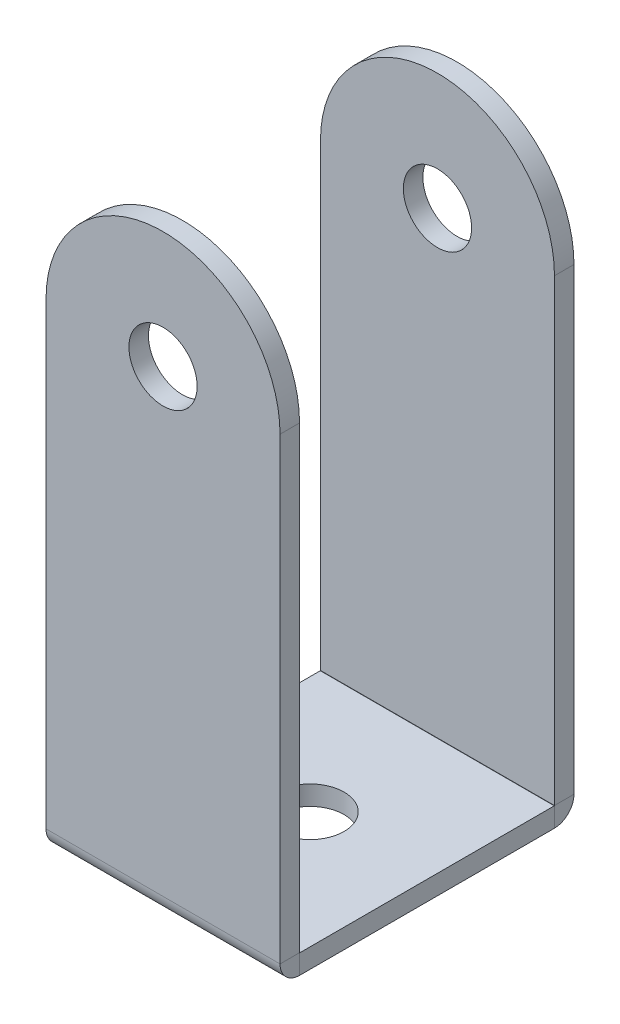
ISO-10303-21;
HEADER;
FILE_DESCRIPTION(('STEP AP214'),'2;1');
FILE_NAME('part.step','',(''),(''),'','','');
FILE_SCHEMA(('AUTOMOTIVE_DESIGN { 1 0 10303 214 1 1 1 1 }'));
ENDSEC;
DATA;
#1=APPLICATION_CONTEXT('core data for automotive mechanical design processes');
#2=APPLICATION_PROTOCOL_DEFINITION('international standard','automotive_design',2000,#1);
#3=PRODUCT_CONTEXT('',#1,'mechanical');
#4=PRODUCT('Part','Part','',(#3));
#5=PRODUCT_RELATED_PRODUCT_CATEGORY('part','',(#4));
#6=PRODUCT_DEFINITION_FORMATION('','',#4);
#7=PRODUCT_DEFINITION_CONTEXT('part definition',#1,'design');
#8=PRODUCT_DEFINITION('design','',#6,#7);
#9=PRODUCT_DEFINITION_SHAPE('','',#8);
#10=(LENGTH_UNIT() NAMED_UNIT(*) SI_UNIT(.MILLI.,.METRE.));
#11=(NAMED_UNIT(*) PLANE_ANGLE_UNIT() SI_UNIT($,.RADIAN.));
#12=(NAMED_UNIT(*) SI_UNIT($,.STERADIAN.) SOLID_ANGLE_UNIT());
#13=UNCERTAINTY_MEASURE_WITH_UNIT(LENGTH_MEASURE(1.E-05),#10,'distance_accuracy_value','');
#14=(GEOMETRIC_REPRESENTATION_CONTEXT(3) GLOBAL_UNCERTAINTY_ASSIGNED_CONTEXT((#13)) GLOBAL_UNIT_ASSIGNED_CONTEXT((#10,
#11,#12)) REPRESENTATION_CONTEXT('',''));
#15=CARTESIAN_POINT('',(0.,0.,0.));
#16=DIRECTION('',(0.,0.,1.));
#17=DIRECTION('',(1.,0.,0.));
#18=AXIS2_PLACEMENT_3D('',#15,#16,#17);
#19=CARTESIAN_POINT('',(0.,-3.72914867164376,-23.4635950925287));
#20=DIRECTION('',(0.,1.,0.));
#21=DIRECTION('',(1.,0.,0.));
#22=AXIS2_PLACEMENT_3D('',#19,#20,#21);
#23=PLANE('',#22);
#24=CARTESIAN_POINT('',(0.,-3.72914867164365,7.53640490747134));
#25=DIRECTION('',(0.,1.,0.));
#26=DIRECTION('',(1.,0.,0.));
#27=AXIS2_PLACEMENT_3D('',#24,#25,#26);
#28=CIRCLE('',#27,1.75);
#29=CARTESIAN_POINT('',(1.75,-3.72914867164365,7.53640490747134));
#30=VERTEX_POINT('',#29);
#31=EDGE_CURVE('E174',#30,#30,#28,.T.);
#32=ORIENTED_EDGE('',*,*,#31,.F.);
#33=EDGE_LOOP('',(#32));
#34=FACE_BOUND('',#33,.T.);
#35=DIRECTION('',(0.,0.,-1.));
#36=VECTOR('',#35,1.);
#37=CARTESIAN_POINT('',(6.,-3.72914867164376,-23.4635950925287));
#38=LINE('',#37,#36);
#39=CARTESIAN_POINT('',(6.,-3.72914867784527,14.0628098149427));
#40=VERTEX_POINT('',#39);
#41=CARTESIAN_POINT('',(6.,-3.72914867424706,1.01));
#42=VERTEX_POINT('',#41);
#43=EDGE_CURVE('E46',#40,#42,#38,.T.);
#44=ORIENTED_EDGE('',*,*,#43,.T.);
#45=DIRECTION('',(-1.,0.,0.));
#46=VECTOR('',#45,1.);
#47=CARTESIAN_POINT('',(0.,-3.72914867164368,1.01));
#48=LINE('',#47,#46);
#49=CARTESIAN_POINT('',(-6.,-3.72914867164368,1.01));
#50=VERTEX_POINT('',#49);
#51=EDGE_CURVE('E144',#42,#50,#48,.T.);
#52=ORIENTED_EDGE('',*,*,#51,.T.);
#53=DIRECTION('',(0.,0.,1.));
#54=VECTOR('',#53,1.);
#55=CARTESIAN_POINT('',(-6.,-3.72914867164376,-23.4635950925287));
#56=LINE('',#55,#54);
#57=CARTESIAN_POINT('',(-6.,-3.72914868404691,14.0628098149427));
#58=VERTEX_POINT('',#57);
#59=EDGE_CURVE('E163',#50,#58,#56,.T.);
#60=ORIENTED_EDGE('',*,*,#59,.T.);
#61=DIRECTION('',(-1.,0.,0.));
#62=VECTOR('',#61,1.);
#63=CARTESIAN_POINT('',(0.,-3.72914867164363,14.0628098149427));
#64=LINE('',#63,#62);
#65=EDGE_CURVE('E181',#40,#58,#64,.T.);
#66=ORIENTED_EDGE('',*,*,#65,.F.);
#67=EDGE_LOOP('',(#44,#52,#60,#66));
#68=FACE_BOUND('',#67,.T.);
#69=ADVANCED_FACE('F42',(#34,#68),#23,.T.);
#70=CARTESIAN_POINT('',(6.,-3.72914867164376,-23.4635950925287));
#71=DIRECTION('',(-1.,0.,0.));
#72=DIRECTION('',(0.,0.,1.));
#73=AXIS2_PLACEMENT_3D('',#70,#71,#72);
#74=PLANE('',#73);
#75=DIRECTION('',(0.,-1.,0.));
#76=VECTOR('',#75,1.);
#77=CARTESIAN_POINT('',(6.,-3.72914867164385,1.01));
#78=LINE('',#77,#76);
#79=CARTESIAN_POINT('',(6.,-4.72914867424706,1.01));
#80=VERTEX_POINT('',#79);
#81=EDGE_CURVE('E133',#42,#80,#78,.T.);
#82=ORIENTED_EDGE('',*,*,#81,.F.);
#83=ORIENTED_EDGE('',*,*,#43,.F.);
#84=DIRECTION('',(0.,-1.,0.));
#85=VECTOR('',#84,1.);
#86=CARTESIAN_POINT('',(6.,-3.72914867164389,14.0628098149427));
#87=LINE('',#86,#85);
#88=CARTESIAN_POINT('',(6.,-4.72914867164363,14.0628098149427));
#89=VERTEX_POINT('',#88);
#90=EDGE_CURVE('E160',#40,#89,#87,.T.);
#91=ORIENTED_EDGE('',*,*,#90,.T.);
#92=DIRECTION('',(0.,0.,-1.));
#93=VECTOR('',#92,1.);
#94=CARTESIAN_POINT('',(6.,-4.72914867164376,-23.4635950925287));
#95=LINE('',#94,#93);
#96=EDGE_CURVE('E158',#89,#80,#95,.T.);
#97=ORIENTED_EDGE('',*,*,#96,.T.);
#98=EDGE_LOOP('',(#82,#83,#91,#97));
#99=FACE_BOUND('',#98,.T.);
#100=ADVANCED_FACE('F159',(#99),#74,.F.);
#101=CARTESIAN_POINT('',(-6.,-3.72914867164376,-23.4635950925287));
#102=DIRECTION('',(1.,0.,0.));
#103=DIRECTION('',(0.,0.,-1.));
#104=AXIS2_PLACEMENT_3D('',#101,#102,#103);
#105=PLANE('',#104);
#106=DIRECTION('',(0.,1.,0.));
#107=VECTOR('',#106,1.);
#108=CARTESIAN_POINT('',(-6.,-3.72914867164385,1.01));
#109=LINE('',#108,#107);
#110=CARTESIAN_POINT('',(-6.,-4.72914867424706,1.01));
#111=VERTEX_POINT('',#110);
#112=EDGE_CURVE('E12',#111,#50,#109,.T.);
#113=ORIENTED_EDGE('',*,*,#112,.F.);
#114=DIRECTION('',(0.,0.,1.));
#115=VECTOR('',#114,1.);
#116=CARTESIAN_POINT('',(-6.,-4.72914867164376,-23.4635950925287));
#117=LINE('',#116,#115);
#118=CARTESIAN_POINT('',(-6.,-4.72914868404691,14.0628098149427));
#119=VERTEX_POINT('',#118);
#120=EDGE_CURVE('E164',#111,#119,#117,.T.);
#121=ORIENTED_EDGE('',*,*,#120,.T.);
#122=DIRECTION('',(0.,1.,0.));
#123=VECTOR('',#122,1.);
#124=CARTESIAN_POINT('',(-6.,-3.72914867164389,14.0628098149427));
#125=LINE('',#124,#123);
#126=EDGE_CURVE('E182',#119,#58,#125,.T.);
#127=ORIENTED_EDGE('',*,*,#126,.T.);
#128=ORIENTED_EDGE('',*,*,#59,.F.);
#129=EDGE_LOOP('',(#113,#121,#127,#128));
#130=FACE_BOUND('',#129,.T.);
#131=ADVANCED_FACE('F44',(#130),#105,.F.);
#132=CARTESIAN_POINT('',(0.,-4.72914867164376,-23.4635950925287));
#133=DIRECTION('',(0.,1.,0.));
#134=DIRECTION('',(1.,0.,0.));
#135=AXIS2_PLACEMENT_3D('',#132,#133,#134);
#136=PLANE('',#135);
#137=DIRECTION('',(-1.,0.,0.));
#138=VECTOR('',#137,1.);
#139=CARTESIAN_POINT('',(0.,-4.72914867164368,1.01));
#140=LINE('',#139,#138);
#141=EDGE_CURVE('E51',#80,#111,#140,.T.);
#142=ORIENTED_EDGE('',*,*,#141,.F.);
#143=ORIENTED_EDGE('',*,*,#96,.F.);
#144=DIRECTION('',(-1.,0.,0.));
#145=VECTOR('',#144,1.);
#146=CARTESIAN_POINT('',(0.,-4.72914867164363,14.0628098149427));
#147=LINE('',#146,#145);
#148=EDGE_CURVE('E188',#89,#119,#147,.T.);
#149=ORIENTED_EDGE('',*,*,#148,.T.);
#150=ORIENTED_EDGE('',*,*,#120,.F.);
#151=EDGE_LOOP('',(#142,#143,#149,#150));
#152=FACE_BOUND('',#151,.T.);
#153=CARTESIAN_POINT('',(0.,-4.72914867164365,7.53640490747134));
#154=DIRECTION('',(0.,1.,0.));
#155=DIRECTION('',(1.,0.,0.));
#156=AXIS2_PLACEMENT_3D('',#153,#154,#155);
#157=CIRCLE('',#156,1.75);
#158=CARTESIAN_POINT('',(1.75,-4.72914867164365,7.53640490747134));
#159=VERTEX_POINT('',#158);
#160=EDGE_CURVE('E214',#159,#159,#157,.T.);
#161=ORIENTED_EDGE('',*,*,#160,.T.);
#162=EDGE_LOOP('',(#161));
#163=FACE_BOUND('',#162,.T.);
#164=ADVANCED_FACE('F167',(#152,#163),#136,.F.);
#165=CARTESIAN_POINT('',(0.,-3.72914867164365,7.53640490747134));
#166=DIRECTION('',(0.,-1.,0.));
#167=DIRECTION('',(-1.,0.,0.));
#168=AXIS2_PLACEMENT_3D('',#165,#166,#167);
#169=CYLINDRICAL_SURFACE('',#168,1.75);
#170=ORIENTED_EDGE('',*,*,#31,.T.);
#171=EDGE_LOOP('',(#170));
#172=FACE_BOUND('',#171,.T.);
#173=ORIENTED_EDGE('',*,*,#160,.F.);
#174=EDGE_LOOP('',(#173));
#175=FACE_BOUND('',#174,.T.);
#176=ADVANCED_FACE('F220',(#172,#175),#169,.F.);
#177=CARTESIAN_POINT('',(6.,-3.71914865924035,14.0628098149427));
#178=DIRECTION('',(-1.,0.,0.));
#179=DIRECTION('',(0.,1.,0.));
#180=AXIS2_PLACEMENT_3D('',#177,#178,#179);
#181=PLANE('',#180);
#182=DIRECTION('',(0.,0.,1.));
#183=VECTOR('',#182,1.);
#184=CARTESIAN_POINT('',(6.,-3.71914867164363,14.072809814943));
#185=LINE('',#184,#183);
#186=CARTESIAN_POINT('',(6.,-3.71914867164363,14.072809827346));
#187=VERTEX_POINT('',#186);
#188=CARTESIAN_POINT('',(6.,-3.71914867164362,15.0728098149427));
#189=VERTEX_POINT('',#188);
#190=EDGE_CURVE('E538',#187,#189,#185,.T.);
#191=ORIENTED_EDGE('',*,*,#190,.T.);
#192=CARTESIAN_POINT('',(6.,-3.71914867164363,14.0628098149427));
#193=DIRECTION('',(1.,0.,0.));
#194=DIRECTION('',(0.,-1.,0.));
#195=AXIS2_PLACEMENT_3D('',#192,#193,#194);
#196=CIRCLE('',#195,1.01000001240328);
#197=EDGE_CURVE('E59',#189,#89,#196,.T.);
#198=ORIENTED_EDGE('',*,*,#197,.T.);
#199=ORIENTED_EDGE('',*,*,#90,.F.);
#200=CARTESIAN_POINT('',(6.,-3.71914865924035,14.0628098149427));
#201=DIRECTION('',(1.,0.,0.));
#202=DIRECTION('',(0.,-1.,0.));
#203=AXIS2_PLACEMENT_3D('',#200,#201,#202);
#204=CIRCLE('',#203,0.0100000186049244);
#205=EDGE_CURVE('E207',#187,#40,#204,.T.);
#206=ORIENTED_EDGE('',*,*,#205,.F.);
#207=EDGE_LOOP('',(#191,#198,#199,#206));
#208=FACE_BOUND('',#207,.T.);
#209=ADVANCED_FACE('F236',(#208),#181,.F.);
#210=CARTESIAN_POINT('',(-6.,-3.71914865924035,14.0628098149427));
#211=DIRECTION('',(1.,0.,0.));
#212=DIRECTION('',(0.,-1.,0.));
#213=AXIS2_PLACEMENT_3D('',#210,#211,#212);
#214=PLANE('',#213);
#215=CARTESIAN_POINT('',(-6.,-3.71914867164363,14.0628098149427));
#216=DIRECTION('',(1.,0.,0.));
#217=DIRECTION('',(0.,-1.,0.));
#218=AXIS2_PLACEMENT_3D('',#215,#216,#217);
#219=CIRCLE('',#218,1.01000001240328);
#220=CARTESIAN_POINT('',(-6.,-3.71914867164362,15.0728098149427));
#221=VERTEX_POINT('',#220);
#222=EDGE_CURVE('E200',#119,#221,#219,.F.);
#223=ORIENTED_EDGE('',*,*,#222,.T.);
#224=DIRECTION('',(0.,0.,-1.));
#225=VECTOR('',#224,1.);
#226=CARTESIAN_POINT('',(-6.,-3.71914867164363,14.072809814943));
#227=LINE('',#226,#225);
#228=CARTESIAN_POINT('',(-6.,-3.71914867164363,14.0728098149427));
#229=VERTEX_POINT('',#228);
#230=EDGE_CURVE('E510',#221,#229,#227,.T.);
#231=ORIENTED_EDGE('',*,*,#230,.T.);
#232=CARTESIAN_POINT('',(-6.,-3.71914865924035,14.0628098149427));
#233=DIRECTION('',(-1.,0.,0.));
#234=DIRECTION('',(0.,1.,0.));
#235=AXIS2_PLACEMENT_3D('',#232,#233,#234);
#236=CIRCLE('',#235,0.0100000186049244);
#237=EDGE_CURVE('E201',#58,#229,#236,.T.);
#238=ORIENTED_EDGE('',*,*,#237,.F.);
#239=ORIENTED_EDGE('',*,*,#126,.F.);
#240=EDGE_LOOP('',(#223,#231,#238,#239));
#241=FACE_BOUND('',#240,.T.);
#242=ADVANCED_FACE('F198',(#241),#214,.F.);
#243=CARTESIAN_POINT('',(-12.0787900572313,-3.71914867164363,14.0628098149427));
#244=DIRECTION('',(1.,0.,0.));
#245=DIRECTION('',(0.,-1.,0.));
#246=AXIS2_PLACEMENT_3D('',#243,#244,#245);
#247=CYLINDRICAL_SURFACE('',#246,0.0100000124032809);
#248=ORIENTED_EDGE('',*,*,#65,.T.);
#249=ORIENTED_EDGE('',*,*,#237,.T.);
#250=DIRECTION('',(-1.,0.,0.));
#251=VECTOR('',#250,1.);
#252=CARTESIAN_POINT('',(0.,-3.71914867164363,14.0728098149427));
#253=LINE('',#252,#251);
#254=EDGE_CURVE('E530',#187,#229,#253,.T.);
#255=ORIENTED_EDGE('',*,*,#254,.F.);
#256=ORIENTED_EDGE('',*,*,#205,.T.);
#257=EDGE_LOOP('',(#248,#249,#255,#256));
#258=FACE_BOUND('',#257,.T.);
#259=ADVANCED_FACE('F276',(#258),#247,.F.);
#260=CARTESIAN_POINT('',(-12.0787900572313,-3.71914867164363,14.0628098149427));
#261=DIRECTION('',(1.,0.,0.));
#262=DIRECTION('',(0.,-1.,0.));
#263=AXIS2_PLACEMENT_3D('',#260,#261,#262);
#264=CYLINDRICAL_SURFACE('',#263,1.01000001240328);
#265=ORIENTED_EDGE('',*,*,#148,.F.);
#266=ORIENTED_EDGE('',*,*,#197,.F.);
#267=DIRECTION('',(-1.,0.,0.));
#268=VECTOR('',#267,1.);
#269=CARTESIAN_POINT('',(0.,-3.71914867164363,15.0728098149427));
#270=LINE('',#269,#268);
#271=EDGE_CURVE('E206',#189,#221,#270,.T.);
#272=ORIENTED_EDGE('',*,*,#271,.T.);
#273=ORIENTED_EDGE('',*,*,#222,.F.);
#274=EDGE_LOOP('',(#265,#266,#272,#273));
#275=FACE_BOUND('',#274,.T.);
#276=ADVANCED_FACE('F204',(#275),#264,.T.);
#277=CARTESIAN_POINT('',(0.,19.8072562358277,14.0728098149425));
#278=DIRECTION('',(0.,0.,1.));
#279=DIRECTION('',(-1.,0.,0.));
#280=AXIS2_PLACEMENT_3D('',#277,#278,#279);
#281=CYLINDRICAL_SURFACE('',#280,6.);
#282=CARTESIAN_POINT('',(0.,19.8072562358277,15.0728098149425));
#283=DIRECTION('',(0.,0.,-1.));
#284=DIRECTION('',(1.,0.,0.));
#285=AXIS2_PLACEMENT_3D('',#282,#283,#284);
#286=CIRCLE('',#285,6.);
#287=CARTESIAN_POINT('',(-6.,19.8072562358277,15.0728098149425));
#288=VERTEX_POINT('',#287);
#289=CARTESIAN_POINT('',(6.,19.8072562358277,15.0728098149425));
#290=VERTEX_POINT('',#289);
#291=EDGE_CURVE('E502',#288,#290,#286,.T.);
#292=ORIENTED_EDGE('',*,*,#291,.T.);
#293=DIRECTION('',(0.,0.,1.));
#294=VECTOR('',#293,1.);
#295=CARTESIAN_POINT('',(6.,19.8072562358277,14.0728098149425));
#296=LINE('',#295,#294);
#297=CARTESIAN_POINT('',(6.,19.8072562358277,14.0728098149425));
#298=VERTEX_POINT('',#297);
#299=EDGE_CURVE('E505',#298,#290,#296,.T.);
#300=ORIENTED_EDGE('',*,*,#299,.F.);
#301=CARTESIAN_POINT('',(0.,19.8072562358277,14.0728098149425));
#302=DIRECTION('',(0.,0.,-1.));
#303=DIRECTION('',(1.,0.,0.));
#304=AXIS2_PLACEMENT_3D('',#301,#302,#303);
#305=CIRCLE('',#304,6.);
#306=CARTESIAN_POINT('',(-6.,19.8072562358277,14.0728098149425));
#307=VERTEX_POINT('',#306);
#308=EDGE_CURVE('E526',#307,#298,#305,.T.);
#309=ORIENTED_EDGE('',*,*,#308,.F.);
#310=DIRECTION('',(0.,0.,1.));
#311=VECTOR('',#310,1.);
#312=CARTESIAN_POINT('',(-6.,19.8072562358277,14.0728098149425));
#313=LINE('',#312,#311);
#314=EDGE_CURVE('E508',#307,#288,#313,.T.);
#315=ORIENTED_EDGE('',*,*,#314,.T.);
#316=EDGE_LOOP('',(#292,#300,#309,#315));
#317=FACE_BOUND('',#316,.T.);
#318=ADVANCED_FACE('F302',(#317),#281,.T.);
#319=CARTESIAN_POINT('',(0.,19.8072562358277,14.0728098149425));
#320=DIRECTION('',(0.,0.,1.));
#321=DIRECTION('',(-1.,0.,0.));
#322=AXIS2_PLACEMENT_3D('',#319,#320,#321);
#323=CYLINDRICAL_SURFACE('',#322,1.75);
#324=CARTESIAN_POINT('',(0.,19.8072562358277,14.0728098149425));
#325=DIRECTION('',(0.,0.,-1.));
#326=DIRECTION('',(1.,0.,0.));
#327=AXIS2_PLACEMENT_3D('',#324,#325,#326);
#328=CIRCLE('',#327,1.75);
#329=CARTESIAN_POINT('',(1.75,19.8072562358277,14.0728098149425));
#330=VERTEX_POINT('',#329);
#331=EDGE_CURVE('E533',#330,#330,#328,.T.);
#332=ORIENTED_EDGE('',*,*,#331,.T.);
#333=EDGE_LOOP('',(#332));
#334=FACE_BOUND('',#333,.T.);
#335=CARTESIAN_POINT('',(0.,19.8072562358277,15.0728098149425));
#336=DIRECTION('',(0.,0.,-1.));
#337=DIRECTION('',(1.,0.,0.));
#338=AXIS2_PLACEMENT_3D('',#335,#336,#337);
#339=CIRCLE('',#338,1.75);
#340=CARTESIAN_POINT('',(1.75,19.8072562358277,15.0728098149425));
#341=VERTEX_POINT('',#340);
#342=EDGE_CURVE('E514',#341,#341,#339,.T.);
#343=ORIENTED_EDGE('',*,*,#342,.F.);
#344=EDGE_LOOP('',(#343));
#345=FACE_BOUND('',#344,.T.);
#346=ADVANCED_FACE('F316',(#334,#345),#323,.F.);
#347=CARTESIAN_POINT('',(0.,-42.1927437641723,14.072809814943));
#348=DIRECTION('',(0.,0.,-1.));
#349=DIRECTION('',(1.,0.,0.));
#350=AXIS2_PLACEMENT_3D('',#347,#348,#349);
#351=PLANE('',#350);
#352=ORIENTED_EDGE('',*,*,#331,.F.);
#353=EDGE_LOOP('',(#352));
#354=FACE_BOUND('',#353,.T.);
#355=DIRECTION('',(0.,-1.,0.));
#356=VECTOR('',#355,1.);
#357=CARTESIAN_POINT('',(6.,-42.1927437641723,14.072809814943));
#358=LINE('',#357,#356);
#359=EDGE_CURVE('E513',#298,#187,#358,.T.);
#360=ORIENTED_EDGE('',*,*,#359,.T.);
#361=ORIENTED_EDGE('',*,*,#254,.T.);
#362=DIRECTION('',(0.,1.,0.));
#363=VECTOR('',#362,1.);
#364=CARTESIAN_POINT('',(-6.,-42.1927437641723,14.072809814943));
#365=LINE('',#364,#363);
#366=EDGE_CURVE('E528',#229,#307,#365,.T.);
#367=ORIENTED_EDGE('',*,*,#366,.T.);
#368=ORIENTED_EDGE('',*,*,#308,.T.);
#369=EDGE_LOOP('',(#360,#361,#367,#368));
#370=FACE_BOUND('',#369,.T.);
#371=ADVANCED_FACE('F308',(#354,#370),#351,.T.);
#372=CARTESIAN_POINT('',(-6.,-42.1927437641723,14.072809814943));
#373=DIRECTION('',(1.,0.,0.));
#374=DIRECTION('',(0.,-1.,0.));
#375=AXIS2_PLACEMENT_3D('',#372,#373,#374);
#376=PLANE('',#375);
#377=ORIENTED_EDGE('',*,*,#230,.F.);
#378=DIRECTION('',(0.,1.,0.));
#379=VECTOR('',#378,1.);
#380=CARTESIAN_POINT('',(-6.,-42.1927437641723,15.072809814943));
#381=LINE('',#380,#379);
#382=EDGE_CURVE('E524',#221,#288,#381,.T.);
#383=ORIENTED_EDGE('',*,*,#382,.T.);
#384=ORIENTED_EDGE('',*,*,#314,.F.);
#385=ORIENTED_EDGE('',*,*,#366,.F.);
#386=EDGE_LOOP('',(#377,#383,#384,#385));
#387=FACE_BOUND('',#386,.T.);
#388=ADVANCED_FACE('F315',(#387),#376,.F.);
#389=CARTESIAN_POINT('',(0.,-42.1927437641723,15.072809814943));
#390=DIRECTION('',(0.,0.,-1.));
#391=DIRECTION('',(1.,0.,0.));
#392=AXIS2_PLACEMENT_3D('',#389,#390,#391);
#393=PLANE('',#392);
#394=ORIENTED_EDGE('',*,*,#271,.F.);
#395=DIRECTION('',(0.,-1.,0.));
#396=VECTOR('',#395,1.);
#397=CARTESIAN_POINT('',(6.,-42.1927437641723,15.072809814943));
#398=LINE('',#397,#396);
#399=EDGE_CURVE('E210',#290,#189,#398,.T.);
#400=ORIENTED_EDGE('',*,*,#399,.F.);
#401=ORIENTED_EDGE('',*,*,#291,.F.);
#402=ORIENTED_EDGE('',*,*,#382,.F.);
#403=EDGE_LOOP('',(#394,#400,#401,#402));
#404=FACE_BOUND('',#403,.T.);
#405=ORIENTED_EDGE('',*,*,#342,.T.);
#406=EDGE_LOOP('',(#405));
#407=FACE_BOUND('',#406,.T.);
#408=ADVANCED_FACE('F325',(#404,#407),#393,.F.);
#409=CARTESIAN_POINT('',(6.,-42.1927437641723,14.072809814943));
#410=DIRECTION('',(-1.,0.,0.));
#411=DIRECTION('',(0.,1.,0.));
#412=AXIS2_PLACEMENT_3D('',#409,#410,#411);
#413=PLANE('',#412);
#414=ORIENTED_EDGE('',*,*,#190,.F.);
#415=ORIENTED_EDGE('',*,*,#359,.F.);
#416=ORIENTED_EDGE('',*,*,#299,.T.);
#417=ORIENTED_EDGE('',*,*,#399,.T.);
#418=EDGE_LOOP('',(#414,#415,#416,#417));
#419=FACE_BOUND('',#418,.T.);
#420=ADVANCED_FACE('F332',(#419),#413,.F.);
#421=CARTESIAN_POINT('',(0.,19.8072562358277,1.));
#422=DIRECTION('',(0.,0.,-1.));
#423=DIRECTION('',(-1.,0.,0.));
#424=AXIS2_PLACEMENT_3D('',#421,#422,#423);
#425=CYLINDRICAL_SURFACE('',#424,1.75);
#426=CARTESIAN_POINT('',(0.,19.8072562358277,1.));
#427=DIRECTION('',(0.,0.,1.));
#428=DIRECTION('',(1.,0.,0.));
#429=AXIS2_PLACEMENT_3D('',#426,#427,#428);
#430=CIRCLE('',#429,1.75);
#431=CARTESIAN_POINT('',(1.75,19.8072562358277,1.));
#432=VERTEX_POINT('',#431);
#433=EDGE_CURVE('E575',#432,#432,#430,.T.);
#434=ORIENTED_EDGE('',*,*,#433,.T.);
#435=EDGE_LOOP('',(#434));
#436=FACE_BOUND('',#435,.T.);
#437=CARTESIAN_POINT('',(0.,19.8072562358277,0.));
#438=DIRECTION('',(0.,0.,1.));
#439=DIRECTION('',(1.,0.,0.));
#440=AXIS2_PLACEMENT_3D('',#437,#438,#439);
#441=CIRCLE('',#440,1.75);
#442=CARTESIAN_POINT('',(1.75,19.8072562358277,0.));
#443=VERTEX_POINT('',#442);
#444=EDGE_CURVE('E555',#443,#443,#441,.T.);
#445=ORIENTED_EDGE('',*,*,#444,.F.);
#446=EDGE_LOOP('',(#445));
#447=FACE_BOUND('',#446,.T.);
#448=ADVANCED_FACE('F419',(#436,#447),#425,.F.);
#449=CARTESIAN_POINT('',(0.,19.8072562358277,1.));
#450=DIRECTION('',(0.,0.,-1.));
#451=DIRECTION('',(-1.,0.,0.));
#452=AXIS2_PLACEMENT_3D('',#449,#450,#451);
#453=CYLINDRICAL_SURFACE('',#452,6.);
#454=CARTESIAN_POINT('',(0.,19.8072562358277,0.));
#455=DIRECTION('',(0.,0.,1.));
#456=DIRECTION('',(1.,0.,0.));
#457=AXIS2_PLACEMENT_3D('',#454,#455,#456);
#458=CIRCLE('',#457,6.);
#459=CARTESIAN_POINT('',(6.,19.8072562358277,0.));
#460=VERTEX_POINT('',#459);
#461=CARTESIAN_POINT('',(-6.,19.8072562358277,0.));
#462=VERTEX_POINT('',#461);
#463=EDGE_CURVE('E574',#460,#462,#458,.T.);
#464=ORIENTED_EDGE('',*,*,#463,.T.);
#465=DIRECTION('',(0.,0.,-1.));
#466=VECTOR('',#465,1.);
#467=CARTESIAN_POINT('',(-6.,19.8072562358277,1.));
#468=LINE('',#467,#466);
#469=CARTESIAN_POINT('',(-6.,19.8072562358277,1.));
#470=VERTEX_POINT('',#469);
#471=EDGE_CURVE('E539',#470,#462,#468,.T.);
#472=ORIENTED_EDGE('',*,*,#471,.F.);
#473=CARTESIAN_POINT('',(0.,19.8072562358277,1.));
#474=DIRECTION('',(0.,0.,1.));
#475=DIRECTION('',(1.,0.,0.));
#476=AXIS2_PLACEMENT_3D('',#473,#474,#475);
#477=CIRCLE('',#476,6.);
#478=CARTESIAN_POINT('',(6.,19.8072562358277,1.));
#479=VERTEX_POINT('',#478);
#480=EDGE_CURVE('E566',#479,#470,#477,.T.);
#481=ORIENTED_EDGE('',*,*,#480,.F.);
#482=DIRECTION('',(0.,0.,-1.));
#483=VECTOR('',#482,1.);
#484=CARTESIAN_POINT('',(6.,19.8072562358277,1.));
#485=LINE('',#484,#483);
#486=EDGE_CURVE('E571',#479,#460,#485,.T.);
#487=ORIENTED_EDGE('',*,*,#486,.T.);
#488=EDGE_LOOP('',(#464,#472,#481,#487));
#489=FACE_BOUND('',#488,.T.);
#490=ADVANCED_FACE('F411',(#489),#453,.T.);
#491=CARTESIAN_POINT('',(0.,19.8072562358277,1.));
#492=DIRECTION('',(0.,0.,1.));
#493=DIRECTION('',(1.,0.,0.));
#494=AXIS2_PLACEMENT_3D('',#491,#492,#493);
#495=PLANE('',#494);
#496=DIRECTION('',(-1.,0.,0.));
#497=VECTOR('',#496,1.);
#498=CARTESIAN_POINT('',(0.,-3.71914867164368,1.));
#499=LINE('',#498,#497);
#500=CARTESIAN_POINT('',(6.,-3.71914867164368,0.999999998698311));
#501=VERTEX_POINT('',#500);
#502=CARTESIAN_POINT('',(-6.,-3.71914867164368,0.999999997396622));
#503=VERTEX_POINT('',#502);
#504=EDGE_CURVE('E519',#501,#503,#499,.T.);
#505=ORIENTED_EDGE('',*,*,#504,.F.);
#506=DIRECTION('',(0.,1.,0.));
#507=VECTOR('',#506,1.);
#508=CARTESIAN_POINT('',(6.,19.8072562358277,1.));
#509=LINE('',#508,#507);
#510=EDGE_CURVE('E569',#501,#479,#509,.T.);
#511=ORIENTED_EDGE('',*,*,#510,.T.);
#512=ORIENTED_EDGE('',*,*,#480,.T.);
#513=DIRECTION('',(0.,-1.,0.));
#514=VECTOR('',#513,1.);
#515=CARTESIAN_POINT('',(-6.,19.8072562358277,1.));
#516=LINE('',#515,#514);
#517=EDGE_CURVE('E563',#470,#503,#516,.T.);
#518=ORIENTED_EDGE('',*,*,#517,.T.);
#519=EDGE_LOOP('',(#505,#511,#512,#518));
#520=FACE_BOUND('',#519,.T.);
#521=ORIENTED_EDGE('',*,*,#433,.F.);
#522=EDGE_LOOP('',(#521));
#523=FACE_BOUND('',#522,.T.);
#524=ADVANCED_FACE('F404',(#520,#523),#495,.T.);
#525=CARTESIAN_POINT('',(6.,19.8072562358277,1.));
#526=DIRECTION('',(-1.,0.,0.));
#527=DIRECTION('',(0.,-1.,0.));
#528=AXIS2_PLACEMENT_3D('',#525,#526,#527);
#529=PLANE('',#528);
#530=ORIENTED_EDGE('',*,*,#510,.F.);
#531=DIRECTION('',(0.,0.,-1.));
#532=VECTOR('',#531,1.);
#533=CARTESIAN_POINT('',(6.,-3.71914867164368,0.999999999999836));
#534=LINE('',#533,#532);
#535=CARTESIAN_POINT('',(6.,-3.71914867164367,0.));
#536=VERTEX_POINT('',#535);
#537=EDGE_CURVE('E560',#501,#536,#534,.T.);
#538=ORIENTED_EDGE('',*,*,#537,.T.);
#539=DIRECTION('',(0.,1.,0.));
#540=VECTOR('',#539,1.);
#541=CARTESIAN_POINT('',(6.,19.8072562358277,0.));
#542=LINE('',#541,#540);
#543=EDGE_CURVE('E558',#536,#460,#542,.T.);
#544=ORIENTED_EDGE('',*,*,#543,.T.);
#545=ORIENTED_EDGE('',*,*,#486,.F.);
#546=EDGE_LOOP('',(#530,#538,#544,#545));
#547=FACE_BOUND('',#546,.T.);
#548=ADVANCED_FACE('F346',(#547),#529,.F.);
#549=CARTESIAN_POINT('',(0.,19.8072562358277,0.));
#550=DIRECTION('',(0.,0.,1.));
#551=DIRECTION('',(1.,0.,0.));
#552=AXIS2_PLACEMENT_3D('',#549,#550,#551);
#553=PLANE('',#552);
#554=ORIENTED_EDGE('',*,*,#444,.T.);
#555=EDGE_LOOP('',(#554));
#556=FACE_BOUND('',#555,.T.);
#557=ORIENTED_EDGE('',*,*,#543,.F.);
#558=DIRECTION('',(-1.,0.,0.));
#559=VECTOR('',#558,1.);
#560=CARTESIAN_POINT('',(0.,-3.71914867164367,0.));
#561=LINE('',#560,#559);
#562=CARTESIAN_POINT('',(-6.,-3.71914867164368,-2.60337823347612E-09));
#563=VERTEX_POINT('',#562);
#564=EDGE_CURVE('E152',#536,#563,#561,.T.);
#565=ORIENTED_EDGE('',*,*,#564,.T.);
#566=DIRECTION('',(0.,-1.,0.));
#567=VECTOR('',#566,1.);
#568=CARTESIAN_POINT('',(-6.,19.8072562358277,0.));
#569=LINE('',#568,#567);
#570=EDGE_CURVE('E548',#462,#563,#569,.T.);
#571=ORIENTED_EDGE('',*,*,#570,.F.);
#572=ORIENTED_EDGE('',*,*,#463,.F.);
#573=EDGE_LOOP('',(#557,#565,#571,#572));
#574=FACE_BOUND('',#573,.T.);
#575=ADVANCED_FACE('F339',(#556,#574),#553,.F.);
#576=CARTESIAN_POINT('',(-6.,19.8072562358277,1.));
#577=DIRECTION('',(1.,0.,0.));
#578=DIRECTION('',(0.,1.,0.));
#579=AXIS2_PLACEMENT_3D('',#576,#577,#578);
#580=PLANE('',#579);
#581=ORIENTED_EDGE('',*,*,#570,.T.);
#582=DIRECTION('',(0.,0.,1.));
#583=VECTOR('',#582,1.);
#584=CARTESIAN_POINT('',(-6.,-3.71914867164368,0.999999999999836));
#585=LINE('',#584,#583);
#586=EDGE_CURVE('E542',#563,#503,#585,.T.);
#587=ORIENTED_EDGE('',*,*,#586,.T.);
#588=ORIENTED_EDGE('',*,*,#517,.F.);
#589=ORIENTED_EDGE('',*,*,#471,.T.);
#590=EDGE_LOOP('',(#581,#587,#588,#589));
#591=FACE_BOUND('',#590,.T.);
#592=ADVANCED_FACE('F256',(#591),#580,.F.);
#593=CARTESIAN_POINT('',(6.,-3.71914867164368,1.01000000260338));
#594=DIRECTION('',(-1.,0.,0.));
#595=DIRECTION('',(0.,0.,1.));
#596=AXIS2_PLACEMENT_3D('',#593,#594,#595);
#597=PLANE('',#596);
#598=ORIENTED_EDGE('',*,*,#81,.T.);
#599=CARTESIAN_POINT('',(6.,-3.71914867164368,1.01));
#600=DIRECTION('',(1.,0.,0.));
#601=DIRECTION('',(0.,0.,-1.));
#602=AXIS2_PLACEMENT_3D('',#599,#600,#601);
#603=CIRCLE('',#602,1.01000000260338);
#604=EDGE_CURVE('E136',#80,#536,#603,.T.);
#605=ORIENTED_EDGE('',*,*,#604,.T.);
#606=ORIENTED_EDGE('',*,*,#537,.F.);
#607=CARTESIAN_POINT('',(6.,-3.71914867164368,1.01000000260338));
#608=DIRECTION('',(1.,0.,0.));
#609=DIRECTION('',(0.,0.,-1.));
#610=AXIS2_PLACEMENT_3D('',#607,#608,#609);
#611=CIRCLE('',#610,0.0100000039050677);
#612=EDGE_CURVE('E139',#42,#501,#611,.T.);
#613=ORIENTED_EDGE('',*,*,#612,.F.);
#614=EDGE_LOOP('',(#598,#605,#606,#613));
#615=FACE_BOUND('',#614,.T.);
#616=ADVANCED_FACE('F135',(#615),#597,.F.);
#617=CARTESIAN_POINT('',(-6.,-3.71914867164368,1.01000000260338));
#618=DIRECTION('',(1.,0.,0.));
#619=DIRECTION('',(0.,0.,-1.));
#620=AXIS2_PLACEMENT_3D('',#617,#618,#619);
#621=PLANE('',#620);
#622=CARTESIAN_POINT('',(-6.,-3.71914867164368,1.01));
#623=DIRECTION('',(1.,0.,0.));
#624=DIRECTION('',(0.,0.,-1.));
#625=AXIS2_PLACEMENT_3D('',#622,#623,#624);
#626=CIRCLE('',#625,1.01000000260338);
#627=EDGE_CURVE('E154',#563,#111,#626,.F.);
#628=ORIENTED_EDGE('',*,*,#627,.T.);
#629=ORIENTED_EDGE('',*,*,#112,.T.);
#630=CARTESIAN_POINT('',(-6.,-3.71914867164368,1.01000000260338));
#631=DIRECTION('',(-1.,0.,0.));
#632=DIRECTION('',(0.,0.,1.));
#633=AXIS2_PLACEMENT_3D('',#630,#631,#632);
#634=CIRCLE('',#633,0.0100000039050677);
#635=EDGE_CURVE('E67',#503,#50,#634,.T.);
#636=ORIENTED_EDGE('',*,*,#635,.F.);
#637=ORIENTED_EDGE('',*,*,#586,.F.);
#638=EDGE_LOOP('',(#628,#629,#636,#637));
#639=FACE_BOUND('',#638,.T.);
#640=ADVANCED_FACE('F359',(#639),#621,.F.);
#641=CARTESIAN_POINT('',(-12.0787900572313,-3.71914867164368,1.01));
#642=DIRECTION('',(1.,0.,0.));
#643=DIRECTION('',(0.,0.,-1.));
#644=AXIS2_PLACEMENT_3D('',#641,#642,#643);
#645=CYLINDRICAL_SURFACE('',#644,0.0100000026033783);
#646=ORIENTED_EDGE('',*,*,#504,.T.);
#647=ORIENTED_EDGE('',*,*,#635,.T.);
#648=ORIENTED_EDGE('',*,*,#51,.F.);
#649=ORIENTED_EDGE('',*,*,#612,.T.);
#650=EDGE_LOOP('',(#646,#647,#648,#649));
#651=FACE_BOUND('',#650,.T.);
#652=ADVANCED_FACE('F361',(#651),#645,.F.);
#653=CARTESIAN_POINT('',(-12.0787900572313,-3.71914867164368,1.01));
#654=DIRECTION('',(1.,0.,0.));
#655=DIRECTION('',(0.,0.,-1.));
#656=AXIS2_PLACEMENT_3D('',#653,#654,#655);
#657=CYLINDRICAL_SURFACE('',#656,1.01000000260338);
#658=ORIENTED_EDGE('',*,*,#564,.F.);
#659=ORIENTED_EDGE('',*,*,#604,.F.);
#660=ORIENTED_EDGE('',*,*,#141,.T.);
#661=ORIENTED_EDGE('',*,*,#627,.F.);
#662=EDGE_LOOP('',(#658,#659,#660,#661));
#663=FACE_BOUND('',#662,.T.);
#664=ADVANCED_FACE('F147',(#663),#657,.T.);
#665=CLOSED_SHELL('',(#69,#100,#131,#164,#176,#209,#242,#259,#276,#318,#346,#371,#388,#408,#420,
#448,#490,#524,#548,#575,#592,#616,#640,#652,#664));
#666=MANIFOLD_SOLID_BREP('B2',#665);
#667=ADVANCED_BREP_SHAPE_REPRESENTATION('',(#18,#666),#14);
#668=SHAPE_DEFINITION_REPRESENTATION(#9,#667);
ENDSEC;
END-ISO-10303-21;
